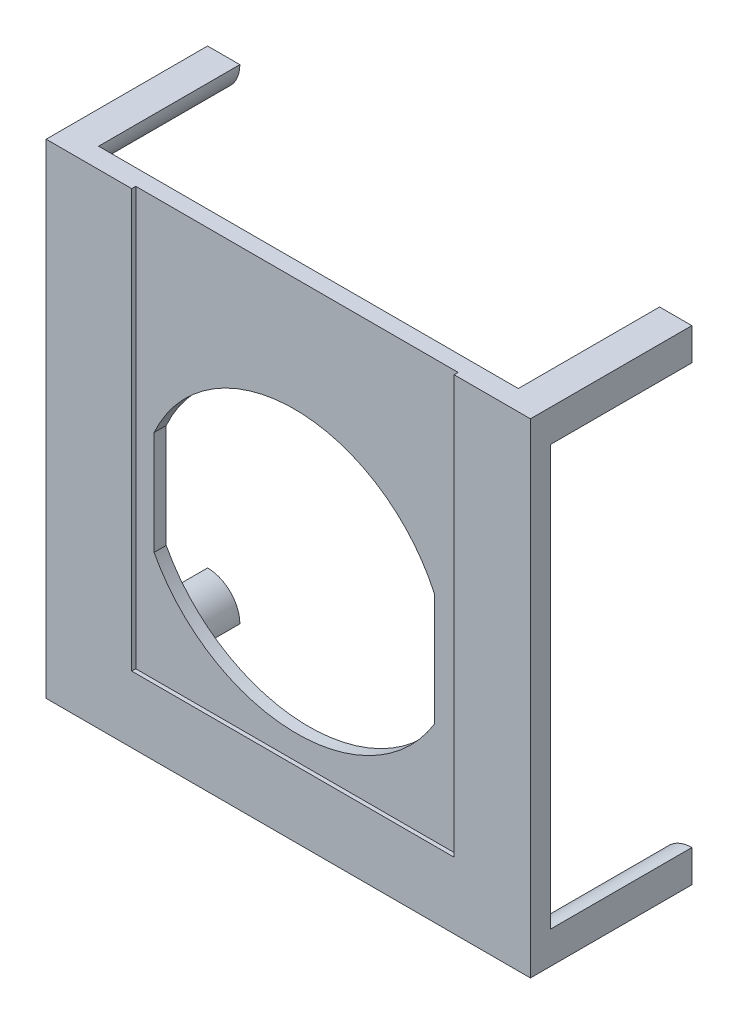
ISO-10303-21;
HEADER;
FILE_DESCRIPTION(('STEP AP214'),'2;1');
FILE_NAME('part.step','',(''),(''),'','','');
FILE_SCHEMA(('AUTOMOTIVE_DESIGN { 1 0 10303 214 1 1 1 1 }'));
ENDSEC;
DATA;
#1=APPLICATION_CONTEXT('core data for automotive mechanical design processes');
#2=APPLICATION_PROTOCOL_DEFINITION('international standard','automotive_design',2000,#1);
#3=PRODUCT_CONTEXT('',#1,'mechanical');
#4=PRODUCT('Part','Part','',(#3));
#5=PRODUCT_RELATED_PRODUCT_CATEGORY('part','',(#4));
#6=PRODUCT_DEFINITION_FORMATION('','',#4);
#7=PRODUCT_DEFINITION_CONTEXT('part definition',#1,'design');
#8=PRODUCT_DEFINITION('design','',#6,#7);
#9=PRODUCT_DEFINITION_SHAPE('','',#8);
#10=(LENGTH_UNIT() NAMED_UNIT(*) SI_UNIT(.MILLI.,.METRE.));
#11=(NAMED_UNIT(*) PLANE_ANGLE_UNIT() SI_UNIT($,.RADIAN.));
#12=(NAMED_UNIT(*) SI_UNIT($,.STERADIAN.) SOLID_ANGLE_UNIT());
#13=UNCERTAINTY_MEASURE_WITH_UNIT(LENGTH_MEASURE(1.E-05),#10,'distance_accuracy_value','');
#14=(GEOMETRIC_REPRESENTATION_CONTEXT(3) GLOBAL_UNCERTAINTY_ASSIGNED_CONTEXT((#13)) GLOBAL_UNIT_ASSIGNED_CONTEXT((#10,
#11,#12)) REPRESENTATION_CONTEXT('',''));
#15=CARTESIAN_POINT('',(0.,0.,0.));
#16=DIRECTION('',(0.,0.,1.));
#17=DIRECTION('',(1.,0.,0.));
#18=AXIS2_PLACEMENT_3D('',#15,#16,#17);
#19=CARTESIAN_POINT('',(0.252700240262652,-3.15234274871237,-0.5));
#20=DIRECTION('',(0.,0.,1.));
#21=DIRECTION('',(1.,0.,0.));
#22=AXIS2_PLACEMENT_3D('',#19,#20,#21);
#23=CYLINDRICAL_SURFACE('',#22,19.0787229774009);
#24=DIRECTION('',(0.,0.,1.));
#25=VECTOR('',#24,1.);
#26=CARTESIAN_POINT('',(-17.127460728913,4.71707115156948,-0.5));
#27=LINE('',#26,#25);
#28=CARTESIAN_POINT('',(-17.127460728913,4.71707115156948,0.5));
#29=VERTEX_POINT('',#28);
#30=CARTESIAN_POINT('',(-17.127460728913,4.71707115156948,2.));
#31=VERTEX_POINT('',#30);
#32=EDGE_CURVE('E349',#29,#31,#27,.T.);
#33=ORIENTED_EDGE('',*,*,#32,.F.);
#34=CARTESIAN_POINT('',(0.252700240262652,-3.15234274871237,0.5));
#35=DIRECTION('',(0.,0.,1.));
#36=DIRECTION('',(1.,0.,0.));
#37=AXIS2_PLACEMENT_3D('',#34,#35,#36);
#38=CIRCLE('',#37,19.0787229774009);
#39=CARTESIAN_POINT('',(17.6328612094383,4.71707115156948,0.5));
#40=VERTEX_POINT('',#39);
#41=EDGE_CURVE('E308',#29,#40,#38,.F.);
#42=ORIENTED_EDGE('',*,*,#41,.T.);
#43=DIRECTION('',(0.,0.,1.));
#44=VECTOR('',#43,1.);
#45=CARTESIAN_POINT('',(17.6328612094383,4.71707115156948,-0.5));
#46=LINE('',#45,#44);
#47=CARTESIAN_POINT('',(17.6328612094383,4.71707115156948,2.));
#48=VERTEX_POINT('',#47);
#49=EDGE_CURVE('E350',#40,#48,#46,.T.);
#50=ORIENTED_EDGE('',*,*,#49,.T.);
#51=CARTESIAN_POINT('',(0.252700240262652,-3.15234274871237,2.));
#52=DIRECTION('',(0.,0.,1.));
#53=DIRECTION('',(1.,0.,0.));
#54=AXIS2_PLACEMENT_3D('',#51,#52,#53);
#55=CIRCLE('',#54,19.0787229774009);
#56=EDGE_CURVE('E346',#31,#48,#55,.F.);
#57=ORIENTED_EDGE('',*,*,#56,.F.);
#58=EDGE_LOOP('',(#33,#42,#50,#57));
#59=FACE_BOUND('',#58,.T.);
#60=ADVANCED_FACE('F37',(#59),#23,.F.);
#61=CARTESIAN_POINT('',(17.6328612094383,4.71707115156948,-0.5));
#62=DIRECTION('',(1.,0.,0.));
#63=DIRECTION('',(0.,0.,-1.));
#64=AXIS2_PLACEMENT_3D('',#61,#62,#63);
#65=PLANE('',#64);
#66=ORIENTED_EDGE('',*,*,#49,.F.);
#67=DIRECTION('',(0.,-1.,0.));
#68=VECTOR('',#67,1.);
#69=CARTESIAN_POINT('',(17.6328612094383,4.71707115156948,0.5));
#70=LINE('',#69,#68);
#71=CARTESIAN_POINT('',(17.6328612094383,-9.15336425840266,0.5));
#72=VERTEX_POINT('',#71);
#73=EDGE_CURVE('E305',#40,#72,#70,.T.);
#74=ORIENTED_EDGE('',*,*,#73,.T.);
#75=DIRECTION('',(0.,0.,1.));
#76=VECTOR('',#75,1.);
#77=CARTESIAN_POINT('',(17.6328612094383,-9.15336425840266,-0.5));
#78=LINE('',#77,#76);
#79=CARTESIAN_POINT('',(17.6328612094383,-9.15336425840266,2.));
#80=VERTEX_POINT('',#79);
#81=EDGE_CURVE('E352',#72,#80,#78,.T.);
#82=ORIENTED_EDGE('',*,*,#81,.T.);
#83=DIRECTION('',(0.,-1.,0.));
#84=VECTOR('',#83,1.);
#85=CARTESIAN_POINT('',(17.6328612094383,4.71707115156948,2.));
#86=LINE('',#85,#84);
#87=EDGE_CURVE('E343',#48,#80,#86,.T.);
#88=ORIENTED_EDGE('',*,*,#87,.F.);
#89=EDGE_LOOP('',(#66,#74,#82,#88));
#90=FACE_BOUND('',#89,.T.);
#91=ADVANCED_FACE('F393',(#90),#65,.F.);
#92=CARTESIAN_POINT('',(0.538638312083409,1.25407550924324,-0.5));
#93=DIRECTION('',(0.,0.,1.));
#94=DIRECTION('',(1.,0.,0.));
#95=AXIS2_PLACEMENT_3D('',#92,#93,#94);
#96=CYLINDRICAL_SURFACE('',#95,20.0131771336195);
#97=ORIENTED_EDGE('',*,*,#81,.F.);
#98=CARTESIAN_POINT('',(0.538638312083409,1.25407550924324,0.5));
#99=DIRECTION('',(0.,0.,1.));
#100=DIRECTION('',(1.,0.,0.));
#101=AXIS2_PLACEMENT_3D('',#98,#99,#100);
#102=CIRCLE('',#101,20.0131771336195);
#103=CARTESIAN_POINT('',(-17.127460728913,-8.14997700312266,0.5));
#104=VERTEX_POINT('',#103);
#105=EDGE_CURVE('E296',#72,#104,#102,.F.);
#106=ORIENTED_EDGE('',*,*,#105,.T.);
#107=DIRECTION('',(0.,0.,1.));
#108=VECTOR('',#107,1.);
#109=CARTESIAN_POINT('',(-17.127460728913,-8.14997700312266,-0.5));
#110=LINE('',#109,#108);
#111=CARTESIAN_POINT('',(-17.127460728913,-8.14997700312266,2.));
#112=VERTEX_POINT('',#111);
#113=EDGE_CURVE('E354',#104,#112,#110,.T.);
#114=ORIENTED_EDGE('',*,*,#113,.T.);
#115=CARTESIAN_POINT('',(0.538638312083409,1.25407550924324,2.));
#116=DIRECTION('',(0.,0.,1.));
#117=DIRECTION('',(1.,0.,0.));
#118=AXIS2_PLACEMENT_3D('',#115,#116,#117);
#119=CIRCLE('',#118,20.0131771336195);
#120=EDGE_CURVE('E335',#80,#112,#119,.F.);
#121=ORIENTED_EDGE('',*,*,#120,.F.);
#122=EDGE_LOOP('',(#97,#106,#114,#121));
#123=FACE_BOUND('',#122,.T.);
#124=ADVANCED_FACE('F396',(#123),#96,.F.);
#125=CARTESIAN_POINT('',(-17.127460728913,4.71707115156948,-0.5));
#126=DIRECTION('',(-1.,0.,0.));
#127=DIRECTION('',(0.,0.,1.));
#128=AXIS2_PLACEMENT_3D('',#125,#126,#127);
#129=PLANE('',#128);
#130=ORIENTED_EDGE('',*,*,#113,.F.);
#131=DIRECTION('',(0.,1.,0.));
#132=VECTOR('',#131,1.);
#133=CARTESIAN_POINT('',(-17.127460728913,4.71707115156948,0.5));
#134=LINE('',#133,#132);
#135=EDGE_CURVE('E11',#104,#29,#134,.T.);
#136=ORIENTED_EDGE('',*,*,#135,.T.);
#137=ORIENTED_EDGE('',*,*,#32,.T.);
#138=DIRECTION('',(0.,1.,0.));
#139=VECTOR('',#138,1.);
#140=CARTESIAN_POINT('',(-17.127460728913,4.71707115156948,2.));
#141=LINE('',#140,#139);
#142=EDGE_CURVE('E45',#112,#31,#141,.T.);
#143=ORIENTED_EDGE('',*,*,#142,.F.);
#144=EDGE_LOOP('',(#130,#136,#137,#143));
#145=FACE_BOUND('',#144,.T.);
#146=ADVANCED_FACE('F397',(#145),#129,.F.);
#147=CARTESIAN_POINT('',(-30.,-30.,2.5));
#148=DIRECTION('',(1.,0.,0.));
#149=DIRECTION('',(0.,0.,-1.));
#150=AXIS2_PLACEMENT_3D('',#147,#148,#149);
#151=PLANE('',#150);
#152=DIRECTION('',(0.,0.,-1.));
#153=VECTOR('',#152,1.);
#154=CARTESIAN_POINT('',(-30.,30.,2.5));
#155=LINE('',#154,#153);
#156=CARTESIAN_POINT('',(-30.,30.,2.5));
#157=VERTEX_POINT('',#156);
#158=CARTESIAN_POINT('',(-30.,30.,-17.5));
#159=VERTEX_POINT('',#158);
#160=EDGE_CURVE('E369',#157,#159,#155,.T.);
#161=ORIENTED_EDGE('',*,*,#160,.T.);
#162=DIRECTION('',(0.,1.,0.));
#163=VECTOR('',#162,1.);
#164=CARTESIAN_POINT('',(-30.,30.,-17.5));
#165=LINE('',#164,#163);
#166=CARTESIAN_POINT('',(-30.,26.,-17.5));
#167=VERTEX_POINT('',#166);
#168=EDGE_CURVE('E249',#167,#159,#165,.T.);
#169=ORIENTED_EDGE('',*,*,#168,.F.);
#170=DIRECTION('',(0.,0.,1.));
#171=VECTOR('',#170,1.);
#172=CARTESIAN_POINT('',(-30.,26.,-17.5));
#173=LINE('',#172,#171);
#174=CARTESIAN_POINT('',(-30.,26.,0.));
#175=VERTEX_POINT('',#174);
#176=EDGE_CURVE('E241',#167,#175,#173,.T.);
#177=ORIENTED_EDGE('',*,*,#176,.T.);
#178=DIRECTION('',(0.,-1.,0.));
#179=VECTOR('',#178,1.);
#180=CARTESIAN_POINT('',(-30.,-30.,0.));
#181=LINE('',#180,#179);
#182=CARTESIAN_POINT('',(-30.,-26.,0.));
#183=VERTEX_POINT('',#182);
#184=EDGE_CURVE('E202',#175,#183,#181,.T.);
#185=ORIENTED_EDGE('',*,*,#184,.T.);
#186=DIRECTION('',(0.,0.,1.));
#187=VECTOR('',#186,1.);
#188=CARTESIAN_POINT('',(-30.,-26.,-17.5));
#189=LINE('',#188,#187);
#190=CARTESIAN_POINT('',(-30.,-26.,-17.5));
#191=VERTEX_POINT('',#190);
#192=EDGE_CURVE('E212',#191,#183,#189,.T.);
#193=ORIENTED_EDGE('',*,*,#192,.F.);
#194=DIRECTION('',(0.,1.,0.));
#195=VECTOR('',#194,1.);
#196=CARTESIAN_POINT('',(-30.,-26.,-17.5));
#197=LINE('',#196,#195);
#198=CARTESIAN_POINT('',(-30.,-30.,-17.5));
#199=VERTEX_POINT('',#198);
#200=EDGE_CURVE('E220',#199,#191,#197,.T.);
#201=ORIENTED_EDGE('',*,*,#200,.F.);
#202=DIRECTION('',(0.,0.,-1.));
#203=VECTOR('',#202,1.);
#204=CARTESIAN_POINT('',(-30.,-30.,2.5));
#205=LINE('',#204,#203);
#206=CARTESIAN_POINT('',(-30.,-30.,2.5));
#207=VERTEX_POINT('',#206);
#208=EDGE_CURVE('E379',#207,#199,#205,.T.);
#209=ORIENTED_EDGE('',*,*,#208,.F.);
#210=DIRECTION('',(0.,-1.,0.));
#211=VECTOR('',#210,1.);
#212=CARTESIAN_POINT('',(-30.,-30.,2.5));
#213=LINE('',#212,#211);
#214=EDGE_CURVE('E357',#157,#207,#213,.T.);
#215=ORIENTED_EDGE('',*,*,#214,.F.);
#216=EDGE_LOOP('',(#161,#169,#177,#185,#193,#201,#209,#215));
#217=FACE_BOUND('',#216,.T.);
#218=ADVANCED_FACE('F39',(#217),#151,.F.);
#219=CARTESIAN_POINT('',(30.,-30.,2.5));
#220=DIRECTION('',(0.,1.,0.));
#221=DIRECTION('',(-1.,0.,0.));
#222=AXIS2_PLACEMENT_3D('',#219,#220,#221);
#223=PLANE('',#222);
#224=ORIENTED_EDGE('',*,*,#208,.T.);
#225=DIRECTION('',(-1.,0.,0.));
#226=VECTOR('',#225,1.);
#227=CARTESIAN_POINT('',(-30.,-30.,-17.5));
#228=LINE('',#227,#226);
#229=CARTESIAN_POINT('',(-26.,-30.,-17.5));
#230=VERTEX_POINT('',#229);
#231=EDGE_CURVE('E214',#230,#199,#228,.T.);
#232=ORIENTED_EDGE('',*,*,#231,.F.);
#233=DIRECTION('',(0.,0.,1.));
#234=VECTOR('',#233,1.);
#235=CARTESIAN_POINT('',(-26.,-30.,-17.5));
#236=LINE('',#235,#234);
#237=CARTESIAN_POINT('',(-26.,-30.,0.));
#238=VERTEX_POINT('',#237);
#239=EDGE_CURVE('E209',#230,#238,#236,.T.);
#240=ORIENTED_EDGE('',*,*,#239,.T.);
#241=DIRECTION('',(1.,0.,0.));
#242=VECTOR('',#241,1.);
#243=CARTESIAN_POINT('',(30.,-30.,0.));
#244=LINE('',#243,#242);
#245=CARTESIAN_POINT('',(26.,-30.,0.));
#246=VERTEX_POINT('',#245);
#247=EDGE_CURVE('E59',#238,#246,#244,.T.);
#248=ORIENTED_EDGE('',*,*,#247,.T.);
#249=DIRECTION('',(0.,0.,1.));
#250=VECTOR('',#249,1.);
#251=CARTESIAN_POINT('',(26.,-30.,-17.5));
#252=LINE('',#251,#250);
#253=CARTESIAN_POINT('',(26.,-30.,-17.5));
#254=VERTEX_POINT('',#253);
#255=EDGE_CURVE('E213',#254,#246,#252,.T.);
#256=ORIENTED_EDGE('',*,*,#255,.F.);
#257=DIRECTION('',(-1.,0.,0.));
#258=VECTOR('',#257,1.);
#259=CARTESIAN_POINT('',(26.,-30.,-17.5));
#260=LINE('',#259,#258);
#261=CARTESIAN_POINT('',(30.,-30.,-17.5));
#262=VERTEX_POINT('',#261);
#263=EDGE_CURVE('E235',#262,#254,#260,.T.);
#264=ORIENTED_EDGE('',*,*,#263,.F.);
#265=DIRECTION('',(0.,0.,-1.));
#266=VECTOR('',#265,1.);
#267=CARTESIAN_POINT('',(30.,-30.,2.5));
#268=LINE('',#267,#266);
#269=CARTESIAN_POINT('',(30.,-30.,2.5));
#270=VERTEX_POINT('',#269);
#271=EDGE_CURVE('E377',#270,#262,#268,.T.);
#272=ORIENTED_EDGE('',*,*,#271,.F.);
#273=DIRECTION('',(1.,0.,0.));
#274=VECTOR('',#273,1.);
#275=CARTESIAN_POINT('',(30.,-30.,2.5));
#276=LINE('',#275,#274);
#277=EDGE_CURVE('E360',#207,#270,#276,.T.);
#278=ORIENTED_EDGE('',*,*,#277,.F.);
#279=EDGE_LOOP('',(#224,#232,#240,#248,#256,#264,#272,#278));
#280=FACE_BOUND('',#279,.T.);
#281=ADVANCED_FACE('F216',(#280),#223,.F.);
#282=CARTESIAN_POINT('',(30.,-30.,2.5));
#283=DIRECTION('',(-1.,0.,0.));
#284=DIRECTION('',(0.,0.,1.));
#285=AXIS2_PLACEMENT_3D('',#282,#283,#284);
#286=PLANE('',#285);
#287=ORIENTED_EDGE('',*,*,#271,.T.);
#288=DIRECTION('',(0.,-1.,0.));
#289=VECTOR('',#288,1.);
#290=CARTESIAN_POINT('',(30.,-30.,-17.5));
#291=LINE('',#290,#289);
#292=CARTESIAN_POINT('',(30.,-26.,-17.5));
#293=VERTEX_POINT('',#292);
#294=EDGE_CURVE('E233',#293,#262,#291,.T.);
#295=ORIENTED_EDGE('',*,*,#294,.F.);
#296=DIRECTION('',(0.,0.,1.));
#297=VECTOR('',#296,1.);
#298=CARTESIAN_POINT('',(30.,-26.,-17.5));
#299=LINE('',#298,#297);
#300=CARTESIAN_POINT('',(30.,-26.,0.));
#301=VERTEX_POINT('',#300);
#302=EDGE_CURVE('E227',#293,#301,#299,.T.);
#303=ORIENTED_EDGE('',*,*,#302,.T.);
#304=DIRECTION('',(0.,1.,0.));
#305=VECTOR('',#304,1.);
#306=CARTESIAN_POINT('',(30.,-30.,0.));
#307=LINE('',#306,#305);
#308=CARTESIAN_POINT('',(30.,26.,0.));
#309=VERTEX_POINT('',#308);
#310=EDGE_CURVE('E201',#301,#309,#307,.T.);
#311=ORIENTED_EDGE('',*,*,#310,.T.);
#312=DIRECTION('',(0.,0.,1.));
#313=VECTOR('',#312,1.);
#314=CARTESIAN_POINT('',(30.,26.,-17.5));
#315=LINE('',#314,#313);
#316=CARTESIAN_POINT('',(30.,26.,-17.5));
#317=VERTEX_POINT('',#316);
#318=EDGE_CURVE('E267',#317,#309,#315,.T.);
#319=ORIENTED_EDGE('',*,*,#318,.F.);
#320=DIRECTION('',(0.,-1.,0.));
#321=VECTOR('',#320,1.);
#322=CARTESIAN_POINT('',(30.,26.,-17.5));
#323=LINE('',#322,#321);
#324=CARTESIAN_POINT('',(30.,30.,-17.5));
#325=VERTEX_POINT('',#324);
#326=EDGE_CURVE('E258',#325,#317,#323,.T.);
#327=ORIENTED_EDGE('',*,*,#326,.F.);
#328=DIRECTION('',(0.,0.,-1.));
#329=VECTOR('',#328,1.);
#330=CARTESIAN_POINT('',(30.,30.,2.5));
#331=LINE('',#330,#329);
#332=CARTESIAN_POINT('',(30.,30.,2.5));
#333=VERTEX_POINT('',#332);
#334=EDGE_CURVE('E375',#333,#325,#331,.T.);
#335=ORIENTED_EDGE('',*,*,#334,.F.);
#336=DIRECTION('',(0.,1.,0.));
#337=VECTOR('',#336,1.);
#338=CARTESIAN_POINT('',(30.,-30.,2.5));
#339=LINE('',#338,#337);
#340=EDGE_CURVE('E363',#270,#333,#339,.T.);
#341=ORIENTED_EDGE('',*,*,#340,.F.);
#342=EDGE_LOOP('',(#287,#295,#303,#311,#319,#327,#335,#341));
#343=FACE_BOUND('',#342,.T.);
#344=ADVANCED_FACE('F435',(#343),#286,.F.);
#345=CARTESIAN_POINT('',(30.,30.,2.5));
#346=DIRECTION('',(0.,-1.,0.));
#347=DIRECTION('',(1.,0.,0.));
#348=AXIS2_PLACEMENT_3D('',#345,#346,#347);
#349=PLANE('',#348);
#350=DIRECTION('',(-1.,0.,0.));
#351=VECTOR('',#350,1.);
#352=CARTESIAN_POINT('',(20.5416785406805,30.,2.));
#353=LINE('',#352,#351);
#354=CARTESIAN_POINT('',(20.5416785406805,30.,2.));
#355=VERTEX_POINT('',#354);
#356=CARTESIAN_POINT('',(-19.3959275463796,30.,2.));
#357=VERTEX_POINT('',#356);
#358=EDGE_CURVE('E312',#355,#357,#353,.T.);
#359=ORIENTED_EDGE('',*,*,#358,.F.);
#360=DIRECTION('',(0.,0.,1.));
#361=VECTOR('',#360,1.);
#362=CARTESIAN_POINT('',(20.5416785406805,30.,2.));
#363=LINE('',#362,#361);
#364=CARTESIAN_POINT('',(20.5416785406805,30.,2.5));
#365=VERTEX_POINT('',#364);
#366=EDGE_CURVE('E332',#355,#365,#363,.T.);
#367=ORIENTED_EDGE('',*,*,#366,.T.);
#368=DIRECTION('',(-1.,0.,0.));
#369=VECTOR('',#368,1.);
#370=CARTESIAN_POINT('',(30.,30.,2.5));
#371=LINE('',#370,#369);
#372=EDGE_CURVE('E366',#333,#365,#371,.T.);
#373=ORIENTED_EDGE('',*,*,#372,.F.);
#374=ORIENTED_EDGE('',*,*,#334,.T.);
#375=DIRECTION('',(1.,0.,0.));
#376=VECTOR('',#375,1.);
#377=CARTESIAN_POINT('',(30.,30.,-17.5));
#378=LINE('',#377,#376);
#379=CARTESIAN_POINT('',(26.,30.,-17.5));
#380=VERTEX_POINT('',#379);
#381=EDGE_CURVE('E255',#380,#325,#378,.T.);
#382=ORIENTED_EDGE('',*,*,#381,.F.);
#383=DIRECTION('',(0.,0.,1.));
#384=VECTOR('',#383,1.);
#385=CARTESIAN_POINT('',(26.,30.,-17.5));
#386=LINE('',#385,#384);
#387=CARTESIAN_POINT('',(26.,30.,0.));
#388=VERTEX_POINT('',#387);
#389=EDGE_CURVE('E262',#380,#388,#386,.T.);
#390=ORIENTED_EDGE('',*,*,#389,.T.);
#391=DIRECTION('',(-1.,0.,0.));
#392=VECTOR('',#391,1.);
#393=CARTESIAN_POINT('',(30.,30.,0.));
#394=LINE('',#393,#392);
#395=CARTESIAN_POINT('',(-26.,30.,0.));
#396=VERTEX_POINT('',#395);
#397=EDGE_CURVE('E361',#388,#396,#394,.T.);
#398=ORIENTED_EDGE('',*,*,#397,.T.);
#399=DIRECTION('',(0.,0.,1.));
#400=VECTOR('',#399,1.);
#401=CARTESIAN_POINT('',(-26.,30.,-17.5));
#402=LINE('',#401,#400);
#403=CARTESIAN_POINT('',(-26.,30.,-17.5));
#404=VERTEX_POINT('',#403);
#405=EDGE_CURVE('E232',#404,#396,#402,.T.);
#406=ORIENTED_EDGE('',*,*,#405,.F.);
#407=DIRECTION('',(1.,0.,0.));
#408=VECTOR('',#407,1.);
#409=CARTESIAN_POINT('',(-26.,30.,-17.5));
#410=LINE('',#409,#408);
#411=EDGE_CURVE('E251',#159,#404,#410,.T.);
#412=ORIENTED_EDGE('',*,*,#411,.F.);
#413=ORIENTED_EDGE('',*,*,#160,.F.);
#414=CARTESIAN_POINT('',(-19.3959275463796,30.,2.5));
#415=VERTEX_POINT('',#414);
#416=EDGE_CURVE('E365',#415,#157,#371,.T.);
#417=ORIENTED_EDGE('',*,*,#416,.F.);
#418=DIRECTION('',(0.,0.,1.));
#419=VECTOR('',#418,1.);
#420=CARTESIAN_POINT('',(-19.3959275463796,30.,2.));
#421=LINE('',#420,#419);
#422=EDGE_CURVE('E325',#357,#415,#421,.T.);
#423=ORIENTED_EDGE('',*,*,#422,.F.);
#424=EDGE_LOOP('',(#359,#367,#373,#374,#382,#390,#398,#406,#412,#413,#417,#423));
#425=FACE_BOUND('',#424,.T.);
#426=ADVANCED_FACE('F429',(#425),#349,.F.);
#427=CARTESIAN_POINT('',(0.,0.,2.5));
#428=DIRECTION('',(0.,0.,1.));
#429=DIRECTION('',(1.,0.,0.));
#430=AXIS2_PLACEMENT_3D('',#427,#428,#429);
#431=PLANE('',#430);
#432=DIRECTION('',(0.,1.,0.));
#433=VECTOR('',#432,1.);
#434=CARTESIAN_POINT('',(20.5416785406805,-21.7692688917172,2.5));
#435=LINE('',#434,#433);
#436=CARTESIAN_POINT('',(20.5416785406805,-21.7692688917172,2.5));
#437=VERTEX_POINT('',#436);
#438=EDGE_CURVE('E316',#437,#365,#435,.T.);
#439=ORIENTED_EDGE('',*,*,#438,.F.);
#440=DIRECTION('',(1.,0.,0.));
#441=VECTOR('',#440,1.);
#442=CARTESIAN_POINT('',(-19.3959275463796,-21.7692688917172,2.5));
#443=LINE('',#442,#441);
#444=CARTESIAN_POINT('',(-19.3959275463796,-21.7692688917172,2.5));
#445=VERTEX_POINT('',#444);
#446=EDGE_CURVE('E328',#445,#437,#443,.T.);
#447=ORIENTED_EDGE('',*,*,#446,.F.);
#448=DIRECTION('',(0.,-1.,0.));
#449=VECTOR('',#448,1.);
#450=CARTESIAN_POINT('',(-19.3959275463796,30.,2.5));
#451=LINE('',#450,#449);
#452=EDGE_CURVE('E311',#415,#445,#451,.T.);
#453=ORIENTED_EDGE('',*,*,#452,.F.);
#454=ORIENTED_EDGE('',*,*,#416,.T.);
#455=ORIENTED_EDGE('',*,*,#214,.T.);
#456=ORIENTED_EDGE('',*,*,#277,.T.);
#457=ORIENTED_EDGE('',*,*,#340,.T.);
#458=ORIENTED_EDGE('',*,*,#372,.T.);
#459=EDGE_LOOP('',(#439,#447,#453,#454,#455,#456,#457,#458));
#460=FACE_BOUND('',#459,.T.);
#461=ADVANCED_FACE('F426',(#460),#431,.T.);
#462=CARTESIAN_POINT('',(0.,0.,0.));
#463=DIRECTION('',(0.,0.,1.));
#464=DIRECTION('',(1.,0.,0.));
#465=AXIS2_PLACEMENT_3D('',#462,#463,#464);
#466=PLANE('',#465);
#467=CARTESIAN_POINT('',(-30.,-30.,0.));
#468=DIRECTION('',(0.,0.,-1.));
#469=DIRECTION('',(1.,0.,0.));
#470=AXIS2_PLACEMENT_3D('',#467,#468,#469);
#471=CIRCLE('',#470,4.);
#472=EDGE_CURVE('E52',#183,#238,#471,.T.);
#473=ORIENTED_EDGE('',*,*,#472,.F.);
#474=ORIENTED_EDGE('',*,*,#184,.F.);
#475=CARTESIAN_POINT('',(-30.,30.,0.));
#476=DIRECTION('',(0.,0.,-1.));
#477=DIRECTION('',(-1.,0.,0.));
#478=AXIS2_PLACEMENT_3D('',#475,#476,#477);
#479=CIRCLE('',#478,4.);
#480=EDGE_CURVE('E245',#396,#175,#479,.T.);
#481=ORIENTED_EDGE('',*,*,#480,.F.);
#482=ORIENTED_EDGE('',*,*,#397,.F.);
#483=CARTESIAN_POINT('',(30.,30.,0.));
#484=DIRECTION('',(0.,0.,-1.));
#485=DIRECTION('',(1.,0.,0.));
#486=AXIS2_PLACEMENT_3D('',#483,#484,#485);
#487=CIRCLE('',#486,4.);
#488=EDGE_CURVE('E248',#309,#388,#487,.T.);
#489=ORIENTED_EDGE('',*,*,#488,.F.);
#490=ORIENTED_EDGE('',*,*,#310,.F.);
#491=CARTESIAN_POINT('',(30.,-30.,0.));
#492=DIRECTION('',(0.,0.,-1.));
#493=DIRECTION('',(1.,0.,0.));
#494=AXIS2_PLACEMENT_3D('',#491,#492,#493);
#495=CIRCLE('',#494,4.);
#496=EDGE_CURVE('E199',#246,#301,#495,.T.);
#497=ORIENTED_EDGE('',*,*,#496,.F.);
#498=ORIENTED_EDGE('',*,*,#247,.F.);
#499=EDGE_LOOP('',(#473,#474,#481,#482,#489,#490,#497,#498));
#500=FACE_BOUND('',#499,.T.);
#501=DIRECTION('',(0.,-1.,0.));
#502=VECTOR('',#501,1.);
#503=CARTESIAN_POINT('',(22.7928612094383,-0.773214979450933,0.));
#504=LINE('',#503,#502);
#505=CARTESIAN_POINT('',(22.7928612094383,-0.773214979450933,0.));
#506=VERTEX_POINT('',#505);
#507=CARTESIAN_POINT('',(22.7928612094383,-8.75693719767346,0.));
#508=VERTEX_POINT('',#507);
#509=EDGE_CURVE('E286',#506,#508,#504,.T.);
#510=ORIENTED_EDGE('',*,*,#509,.F.);
#511=CARTESIAN_POINT('',(0.251932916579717,-0.773214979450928,0.));
#512=DIRECTION('',(0.,0.,-1.));
#513=DIRECTION('',(1.,0.,0.));
#514=AXIS2_PLACEMENT_3D('',#511,#512,#513);
#515=CIRCLE('',#514,22.5409282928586);
#516=CARTESIAN_POINT('',(-22.2889953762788,-0.773214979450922,0.));
#517=VERTEX_POINT('',#516);
#518=EDGE_CURVE('E270',#517,#506,#515,.T.);
#519=ORIENTED_EDGE('',*,*,#518,.F.);
#520=DIRECTION('',(0.,1.,0.));
#521=VECTOR('',#520,1.);
#522=CARTESIAN_POINT('',(-22.2889953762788,-0.773214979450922,0.));
#523=LINE('',#522,#521);
#524=CARTESIAN_POINT('',(-22.2889953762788,-8.37255705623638,0.));
#525=VERTEX_POINT('',#524);
#526=EDGE_CURVE('E275',#525,#517,#523,.T.);
#527=ORIENTED_EDGE('',*,*,#526,.F.);
#528=CARTESIAN_POINT('',(0.311525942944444,-1.57540512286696,0.));
#529=DIRECTION('',(0.,0.,-1.));
#530=DIRECTION('',(-1.,0.,0.));
#531=AXIS2_PLACEMENT_3D('',#528,#529,#530);
#532=CIRCLE('',#531,23.6005262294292);
#533=EDGE_CURVE('E289',#508,#525,#532,.T.);
#534=ORIENTED_EDGE('',*,*,#533,.F.);
#535=EDGE_LOOP('',(#510,#519,#527,#534));
#536=FACE_BOUND('',#535,.T.);
#537=ADVANCED_FACE('F196',(#500,#536),#466,.F.);
#538=CARTESIAN_POINT('',(0.,0.,2.));
#539=DIRECTION('',(0.,0.,1.));
#540=DIRECTION('',(1.,0.,0.));
#541=AXIS2_PLACEMENT_3D('',#538,#539,#540);
#542=PLANE('',#541);
#543=ORIENTED_EDGE('',*,*,#358,.T.);
#544=DIRECTION('',(0.,-1.,0.));
#545=VECTOR('',#544,1.);
#546=CARTESIAN_POINT('',(-19.3959275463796,30.,2.));
#547=LINE('',#546,#545);
#548=CARTESIAN_POINT('',(-19.3959275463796,-21.7692688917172,2.));
#549=VERTEX_POINT('',#548);
#550=EDGE_CURVE('E315',#357,#549,#547,.T.);
#551=ORIENTED_EDGE('',*,*,#550,.T.);
#552=DIRECTION('',(1.,0.,0.));
#553=VECTOR('',#552,1.);
#554=CARTESIAN_POINT('',(-19.3959275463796,-21.7692688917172,2.));
#555=LINE('',#554,#553);
#556=CARTESIAN_POINT('',(20.5416785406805,-21.7692688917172,2.));
#557=VERTEX_POINT('',#556);
#558=EDGE_CURVE('E319',#549,#557,#555,.T.);
#559=ORIENTED_EDGE('',*,*,#558,.T.);
#560=DIRECTION('',(0.,1.,0.));
#561=VECTOR('',#560,1.);
#562=CARTESIAN_POINT('',(20.5416785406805,-21.7692688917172,2.));
#563=LINE('',#562,#561);
#564=EDGE_CURVE('E322',#557,#355,#563,.T.);
#565=ORIENTED_EDGE('',*,*,#564,.T.);
#566=EDGE_LOOP('',(#543,#551,#559,#565));
#567=FACE_BOUND('',#566,.T.);
#568=ORIENTED_EDGE('',*,*,#56,.T.);
#569=ORIENTED_EDGE('',*,*,#87,.T.);
#570=ORIENTED_EDGE('',*,*,#120,.T.);
#571=ORIENTED_EDGE('',*,*,#142,.T.);
#572=EDGE_LOOP('',(#568,#569,#570,#571));
#573=FACE_BOUND('',#572,.T.);
#574=ADVANCED_FACE('F384',(#567,#573),#542,.T.);
#575=CARTESIAN_POINT('',(20.5416785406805,-21.7692688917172,2.));
#576=DIRECTION('',(1.,0.,0.));
#577=DIRECTION('',(0.,0.,-1.));
#578=AXIS2_PLACEMENT_3D('',#575,#576,#577);
#579=PLANE('',#578);
#580=ORIENTED_EDGE('',*,*,#438,.T.);
#581=ORIENTED_EDGE('',*,*,#366,.F.);
#582=ORIENTED_EDGE('',*,*,#564,.F.);
#583=DIRECTION('',(0.,0.,1.));
#584=VECTOR('',#583,1.);
#585=CARTESIAN_POINT('',(20.5416785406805,-21.7692688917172,2.));
#586=LINE('',#585,#584);
#587=EDGE_CURVE('E336',#557,#437,#586,.T.);
#588=ORIENTED_EDGE('',*,*,#587,.T.);
#589=EDGE_LOOP('',(#580,#581,#582,#588));
#590=FACE_BOUND('',#589,.T.);
#591=ADVANCED_FACE('F520',(#590),#579,.F.);
#592=CARTESIAN_POINT('',(-19.3959275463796,-21.7692688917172,2.));
#593=DIRECTION('',(0.,-1.,0.));
#594=DIRECTION('',(0.,0.,-1.));
#595=AXIS2_PLACEMENT_3D('',#592,#593,#594);
#596=PLANE('',#595);
#597=ORIENTED_EDGE('',*,*,#446,.T.);
#598=ORIENTED_EDGE('',*,*,#587,.F.);
#599=ORIENTED_EDGE('',*,*,#558,.F.);
#600=DIRECTION('',(0.,0.,1.));
#601=VECTOR('',#600,1.);
#602=CARTESIAN_POINT('',(-19.3959275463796,-21.7692688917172,2.));
#603=LINE('',#602,#601);
#604=EDGE_CURVE('E338',#549,#445,#603,.T.);
#605=ORIENTED_EDGE('',*,*,#604,.T.);
#606=EDGE_LOOP('',(#597,#598,#599,#605));
#607=FACE_BOUND('',#606,.T.);
#608=ADVANCED_FACE('F412',(#607),#596,.F.);
#609=CARTESIAN_POINT('',(-19.3959275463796,30.,2.));
#610=DIRECTION('',(-1.,0.,0.));
#611=DIRECTION('',(0.,0.,1.));
#612=AXIS2_PLACEMENT_3D('',#609,#610,#611);
#613=PLANE('',#612);
#614=ORIENTED_EDGE('',*,*,#452,.T.);
#615=ORIENTED_EDGE('',*,*,#604,.F.);
#616=ORIENTED_EDGE('',*,*,#550,.F.);
#617=ORIENTED_EDGE('',*,*,#422,.T.);
#618=EDGE_LOOP('',(#614,#615,#616,#617));
#619=FACE_BOUND('',#618,.T.);
#620=ADVANCED_FACE('F402',(#619),#613,.F.);
#621=CARTESIAN_POINT('',(0.251932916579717,-0.773214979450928,0.5));
#622=DIRECTION('',(0.,0.,1.));
#623=DIRECTION('',(1.,0.,0.));
#624=AXIS2_PLACEMENT_3D('',#621,#622,#623);
#625=PLANE('',#624);
#626=CARTESIAN_POINT('',(0.251932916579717,-0.773214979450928,0.5));
#627=DIRECTION('',(0.,0.,-1.));
#628=DIRECTION('',(1.,0.,0.));
#629=AXIS2_PLACEMENT_3D('',#626,#627,#628);
#630=CIRCLE('',#629,22.5409282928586);
#631=CARTESIAN_POINT('',(-22.2889953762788,-0.773214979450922,0.5));
#632=VERTEX_POINT('',#631);
#633=CARTESIAN_POINT('',(22.7928612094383,-0.773214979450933,0.5));
#634=VERTEX_POINT('',#633);
#635=EDGE_CURVE('E271',#632,#634,#630,.T.);
#636=ORIENTED_EDGE('',*,*,#635,.T.);
#637=DIRECTION('',(0.,-1.,0.));
#638=VECTOR('',#637,1.);
#639=CARTESIAN_POINT('',(22.7928612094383,-0.773214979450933,0.5));
#640=LINE('',#639,#638);
#641=CARTESIAN_POINT('',(22.7928612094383,-8.75693719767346,0.5));
#642=VERTEX_POINT('',#641);
#643=EDGE_CURVE('E274',#634,#642,#640,.T.);
#644=ORIENTED_EDGE('',*,*,#643,.T.);
#645=CARTESIAN_POINT('',(0.311525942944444,-1.57540512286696,0.5));
#646=DIRECTION('',(0.,0.,-1.));
#647=DIRECTION('',(-1.,0.,0.));
#648=AXIS2_PLACEMENT_3D('',#645,#646,#647);
#649=CIRCLE('',#648,23.6005262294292);
#650=CARTESIAN_POINT('',(-22.2889953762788,-8.37255705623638,0.5));
#651=VERTEX_POINT('',#650);
#652=EDGE_CURVE('E278',#642,#651,#649,.T.);
#653=ORIENTED_EDGE('',*,*,#652,.T.);
#654=DIRECTION('',(0.,1.,0.));
#655=VECTOR('',#654,1.);
#656=CARTESIAN_POINT('',(-22.2889953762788,-0.773214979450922,0.5));
#657=LINE('',#656,#655);
#658=EDGE_CURVE('E281',#651,#632,#657,.T.);
#659=ORIENTED_EDGE('',*,*,#658,.T.);
#660=EDGE_LOOP('',(#636,#644,#653,#659));
#661=FACE_BOUND('',#660,.T.);
#662=ORIENTED_EDGE('',*,*,#135,.F.);
#663=ORIENTED_EDGE('',*,*,#105,.F.);
#664=ORIENTED_EDGE('',*,*,#73,.F.);
#665=ORIENTED_EDGE('',*,*,#41,.F.);
#666=EDGE_LOOP('',(#662,#663,#664,#665));
#667=FACE_BOUND('',#666,.T.);
#668=ADVANCED_FACE('F399',(#661,#667),#625,.F.);
#669=CARTESIAN_POINT('',(0.251932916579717,-0.773214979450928,0.5));
#670=DIRECTION('',(0.,0.,-1.));
#671=DIRECTION('',(-1.,0.,0.));
#672=AXIS2_PLACEMENT_3D('',#669,#670,#671);
#673=CYLINDRICAL_SURFACE('',#672,22.5409282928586);
#674=ORIENTED_EDGE('',*,*,#518,.T.);
#675=DIRECTION('',(0.,0.,-1.));
#676=VECTOR('',#675,1.);
#677=CARTESIAN_POINT('',(22.7928612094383,-0.773214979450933,0.5));
#678=LINE('',#677,#676);
#679=EDGE_CURVE('E284',#634,#506,#678,.T.);
#680=ORIENTED_EDGE('',*,*,#679,.F.);
#681=ORIENTED_EDGE('',*,*,#635,.F.);
#682=DIRECTION('',(0.,0.,-1.));
#683=VECTOR('',#682,1.);
#684=CARTESIAN_POINT('',(-22.2889953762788,-0.773214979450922,0.5));
#685=LINE('',#684,#683);
#686=EDGE_CURVE('E294',#632,#517,#685,.T.);
#687=ORIENTED_EDGE('',*,*,#686,.T.);
#688=EDGE_LOOP('',(#674,#680,#681,#687));
#689=FACE_BOUND('',#688,.T.);
#690=ADVANCED_FACE('F401',(#689),#673,.F.);
#691=CARTESIAN_POINT('',(-22.2889953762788,-0.773214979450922,0.5));
#692=DIRECTION('',(-1.,0.,0.));
#693=DIRECTION('',(0.,0.,1.));
#694=AXIS2_PLACEMENT_3D('',#691,#692,#693);
#695=PLANE('',#694);
#696=ORIENTED_EDGE('',*,*,#526,.T.);
#697=ORIENTED_EDGE('',*,*,#686,.F.);
#698=ORIENTED_EDGE('',*,*,#658,.F.);
#699=DIRECTION('',(0.,0.,-1.));
#700=VECTOR('',#699,1.);
#701=CARTESIAN_POINT('',(-22.2889953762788,-8.37255705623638,0.5));
#702=LINE('',#701,#700);
#703=EDGE_CURVE('E297',#651,#525,#702,.T.);
#704=ORIENTED_EDGE('',*,*,#703,.T.);
#705=EDGE_LOOP('',(#696,#697,#698,#704));
#706=FACE_BOUND('',#705,.T.);
#707=ADVANCED_FACE('F409',(#706),#695,.F.);
#708=CARTESIAN_POINT('',(0.311525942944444,-1.57540512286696,0.5));
#709=DIRECTION('',(0.,0.,-1.));
#710=DIRECTION('',(-1.,0.,0.));
#711=AXIS2_PLACEMENT_3D('',#708,#709,#710);
#712=CYLINDRICAL_SURFACE('',#711,23.6005262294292);
#713=ORIENTED_EDGE('',*,*,#533,.T.);
#714=ORIENTED_EDGE('',*,*,#703,.F.);
#715=ORIENTED_EDGE('',*,*,#652,.F.);
#716=DIRECTION('',(0.,0.,-1.));
#717=VECTOR('',#716,1.);
#718=CARTESIAN_POINT('',(22.7928612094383,-8.75693719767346,0.5));
#719=LINE('',#718,#717);
#720=EDGE_CURVE('E299',#642,#508,#719,.T.);
#721=ORIENTED_EDGE('',*,*,#720,.T.);
#722=EDGE_LOOP('',(#713,#714,#715,#721));
#723=FACE_BOUND('',#722,.T.);
#724=ADVANCED_FACE('F509',(#723),#712,.F.);
#725=CARTESIAN_POINT('',(22.7928612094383,-0.773214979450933,0.5));
#726=DIRECTION('',(1.,0.,0.));
#727=DIRECTION('',(0.,0.,-1.));
#728=AXIS2_PLACEMENT_3D('',#725,#726,#727);
#729=PLANE('',#728);
#730=ORIENTED_EDGE('',*,*,#509,.T.);
#731=ORIENTED_EDGE('',*,*,#720,.F.);
#732=ORIENTED_EDGE('',*,*,#643,.F.);
#733=ORIENTED_EDGE('',*,*,#679,.T.);
#734=EDGE_LOOP('',(#730,#731,#732,#733));
#735=FACE_BOUND('',#734,.T.);
#736=ADVANCED_FACE('F505',(#735),#729,.F.);
#737=CARTESIAN_POINT('',(30.,30.,-17.5));
#738=DIRECTION('',(0.,0.,1.));
#739=DIRECTION('',(1.,0.,0.));
#740=AXIS2_PLACEMENT_3D('',#737,#738,#739);
#741=CYLINDRICAL_SURFACE('',#740,4.);
#742=ORIENTED_EDGE('',*,*,#488,.T.);
#743=ORIENTED_EDGE('',*,*,#389,.F.);
#744=CARTESIAN_POINT('',(30.,30.,-17.5));
#745=DIRECTION('',(0.,0.,-1.));
#746=DIRECTION('',(1.,0.,0.));
#747=AXIS2_PLACEMENT_3D('',#744,#745,#746);
#748=CIRCLE('',#747,4.);
#749=EDGE_CURVE('E260',#317,#380,#748,.T.);
#750=ORIENTED_EDGE('',*,*,#749,.F.);
#751=ORIENTED_EDGE('',*,*,#318,.T.);
#752=EDGE_LOOP('',(#742,#743,#750,#751));
#753=FACE_BOUND('',#752,.T.);
#754=ADVANCED_FACE('F467',(#753),#741,.T.);
#755=CARTESIAN_POINT('',(30.,30.,-17.5));
#756=DIRECTION('',(0.,0.,1.));
#757=DIRECTION('',(1.,0.,0.));
#758=AXIS2_PLACEMENT_3D('',#755,#756,#757);
#759=PLANE('',#758);
#760=ORIENTED_EDGE('',*,*,#381,.T.);
#761=ORIENTED_EDGE('',*,*,#326,.T.);
#762=ORIENTED_EDGE('',*,*,#749,.T.);
#763=EDGE_LOOP('',(#760,#761,#762));
#764=FACE_BOUND('',#763,.T.);
#765=ADVANCED_FACE('F499',(#764),#759,.F.);
#766=CARTESIAN_POINT('',(-30.,30.,-17.5));
#767=DIRECTION('',(0.,0.,1.));
#768=DIRECTION('',(1.,0.,0.));
#769=AXIS2_PLACEMENT_3D('',#766,#767,#768);
#770=CYLINDRICAL_SURFACE('',#769,4.);
#771=ORIENTED_EDGE('',*,*,#480,.T.);
#772=ORIENTED_EDGE('',*,*,#176,.F.);
#773=CARTESIAN_POINT('',(-30.,30.,-17.5));
#774=DIRECTION('',(0.,0.,-1.));
#775=DIRECTION('',(-1.,0.,0.));
#776=AXIS2_PLACEMENT_3D('',#773,#774,#775);
#777=CIRCLE('',#776,4.);
#778=EDGE_CURVE('E244',#404,#167,#777,.T.);
#779=ORIENTED_EDGE('',*,*,#778,.F.);
#780=ORIENTED_EDGE('',*,*,#405,.T.);
#781=EDGE_LOOP('',(#771,#772,#779,#780));
#782=FACE_BOUND('',#781,.T.);
#783=ADVANCED_FACE('F460',(#782),#770,.T.);
#784=CARTESIAN_POINT('',(-30.,30.,-17.5));
#785=DIRECTION('',(0.,0.,-1.));
#786=DIRECTION('',(-1.,0.,0.));
#787=AXIS2_PLACEMENT_3D('',#784,#785,#786);
#788=PLANE('',#787);
#789=ORIENTED_EDGE('',*,*,#168,.T.);
#790=ORIENTED_EDGE('',*,*,#411,.T.);
#791=ORIENTED_EDGE('',*,*,#778,.T.);
#792=EDGE_LOOP('',(#789,#790,#791));
#793=FACE_BOUND('',#792,.T.);
#794=ADVANCED_FACE('F457',(#793),#788,.T.);
#795=CARTESIAN_POINT('',(30.,-30.,-17.5));
#796=DIRECTION('',(0.,0.,1.));
#797=DIRECTION('',(1.,0.,0.));
#798=AXIS2_PLACEMENT_3D('',#795,#796,#797);
#799=CYLINDRICAL_SURFACE('',#798,4.);
#800=ORIENTED_EDGE('',*,*,#496,.T.);
#801=ORIENTED_EDGE('',*,*,#302,.F.);
#802=CARTESIAN_POINT('',(30.,-30.,-17.5));
#803=DIRECTION('',(0.,0.,-1.));
#804=DIRECTION('',(1.,0.,0.));
#805=AXIS2_PLACEMENT_3D('',#802,#803,#804);
#806=CIRCLE('',#805,4.);
#807=EDGE_CURVE('E230',#254,#293,#806,.T.);
#808=ORIENTED_EDGE('',*,*,#807,.F.);
#809=ORIENTED_EDGE('',*,*,#255,.T.);
#810=EDGE_LOOP('',(#800,#801,#808,#809));
#811=FACE_BOUND('',#810,.T.);
#812=ADVANCED_FACE('F471',(#811),#799,.T.);
#813=CARTESIAN_POINT('',(30.,-30.,-17.5));
#814=DIRECTION('',(0.,0.,1.));
#815=DIRECTION('',(1.,0.,0.));
#816=AXIS2_PLACEMENT_3D('',#813,#814,#815);
#817=PLANE('',#816);
#818=ORIENTED_EDGE('',*,*,#294,.T.);
#819=ORIENTED_EDGE('',*,*,#263,.T.);
#820=ORIENTED_EDGE('',*,*,#807,.T.);
#821=EDGE_LOOP('',(#818,#819,#820));
#822=FACE_BOUND('',#821,.T.);
#823=ADVANCED_FACE('F478',(#822),#817,.F.);
#824=CARTESIAN_POINT('',(-30.,-30.,-17.5));
#825=DIRECTION('',(0.,0.,1.));
#826=DIRECTION('',(1.,0.,0.));
#827=AXIS2_PLACEMENT_3D('',#824,#825,#826);
#828=CYLINDRICAL_SURFACE('',#827,4.);
#829=ORIENTED_EDGE('',*,*,#472,.T.);
#830=ORIENTED_EDGE('',*,*,#239,.F.);
#831=CARTESIAN_POINT('',(-30.,-30.,-17.5));
#832=DIRECTION('',(0.,0.,-1.));
#833=DIRECTION('',(1.,0.,0.));
#834=AXIS2_PLACEMENT_3D('',#831,#832,#833);
#835=CIRCLE('',#834,4.);
#836=EDGE_CURVE('E218',#191,#230,#835,.T.);
#837=ORIENTED_EDGE('',*,*,#836,.F.);
#838=ORIENTED_EDGE('',*,*,#192,.T.);
#839=EDGE_LOOP('',(#829,#830,#837,#838));
#840=FACE_BOUND('',#839,.T.);
#841=ADVANCED_FACE('F207',(#840),#828,.T.);
#842=CARTESIAN_POINT('',(-30.,-30.,-17.5));
#843=DIRECTION('',(0.,0.,1.));
#844=DIRECTION('',(1.,0.,0.));
#845=AXIS2_PLACEMENT_3D('',#842,#843,#844);
#846=PLANE('',#845);
#847=ORIENTED_EDGE('',*,*,#231,.T.);
#848=ORIENTED_EDGE('',*,*,#200,.T.);
#849=ORIENTED_EDGE('',*,*,#836,.T.);
#850=EDGE_LOOP('',(#847,#848,#849));
#851=FACE_BOUND('',#850,.T.);
#852=ADVANCED_FACE('F485',(#851),#846,.F.);
#853=CLOSED_SHELL('',(#60,#91,#124,#146,#218,#281,#344,#426,#461,#537,#574,#591,#608,#620,#668,
#690,#707,#724,#736,#754,#765,#783,#794,#812,#823,#841,#852));
#854=MANIFOLD_SOLID_BREP('B2',#853);
#855=ADVANCED_BREP_SHAPE_REPRESENTATION('',(#18,#854),#14);
#856=SHAPE_DEFINITION_REPRESENTATION(#9,#855);
ENDSEC;
END-ISO-10303-21;
